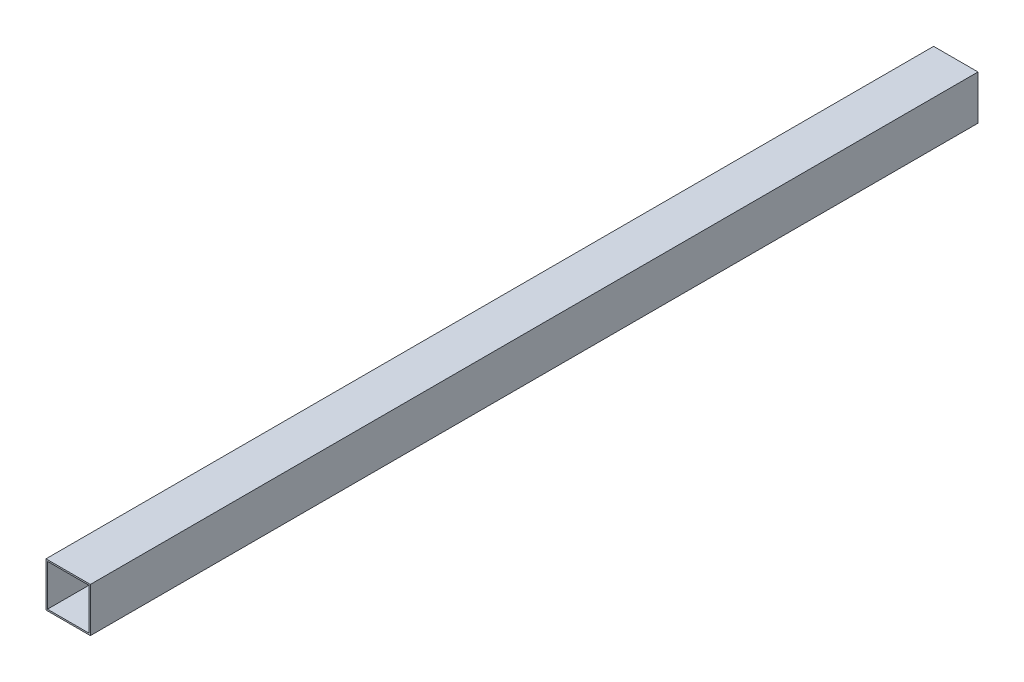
from build123d import *

# Parameters (mm, degrees)
SCHIZZO1_W                = 30
SCHIZZO1_H                = 30
SCHIZZO1_W_2              = 28
SCHIZZO1_H_2              = 28
ESTRUSIONE_SOTTILE1_DEPTH = 600


with BuildPart() as part:
    # Schizzo1 → Estrusione-Sottile1 (new body)
    with BuildSketch(Plane.XY):
        Rectangle(SCHIZZO1_W, SCHIZZO1_H)
        Rectangle(SCHIZZO1_W_2, SCHIZZO1_H_2, mode=Mode.SUBTRACT)
    extrude(amount=ESTRUSIONE_SOTTILE1_DEPTH)


solid = part.part
